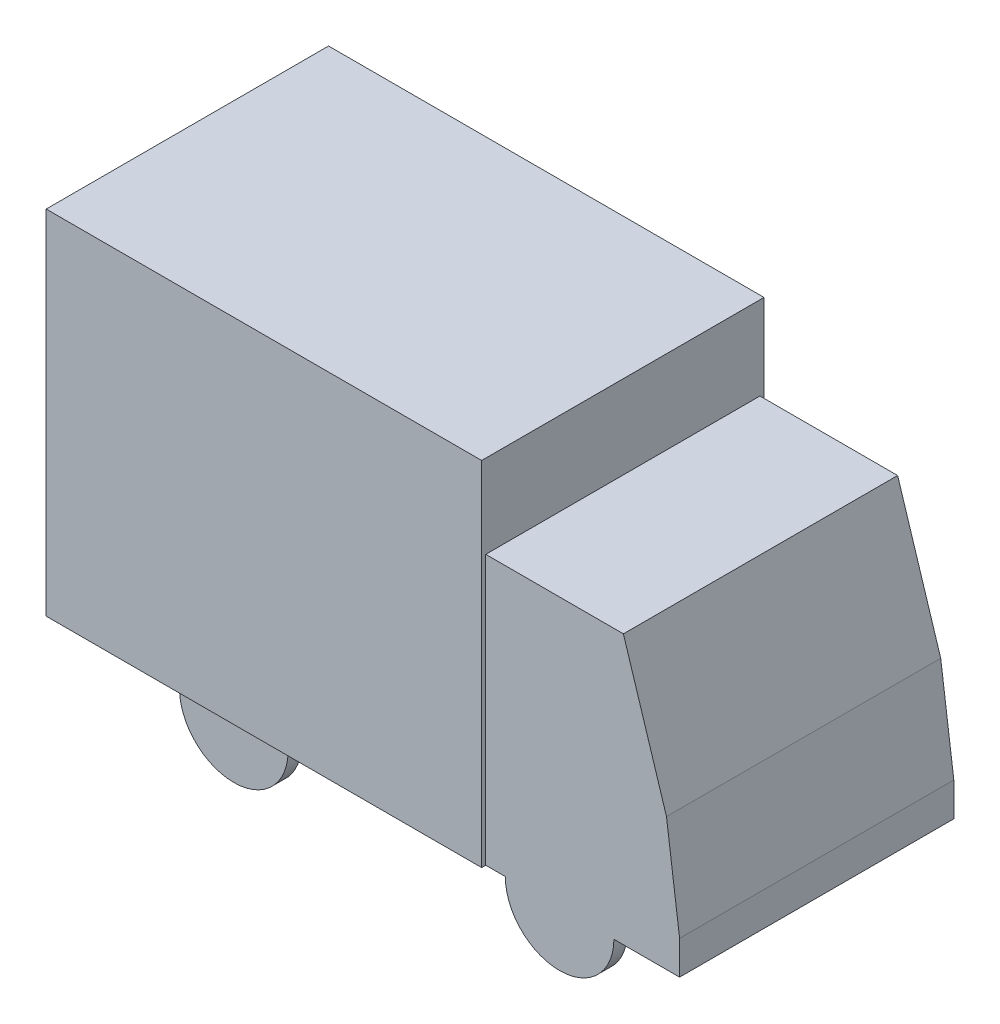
ISO-10303-21;
HEADER;
FILE_DESCRIPTION(('STEP AP214'),'2;1');
FILE_NAME('part.step','',(''),(''),'','','');
FILE_SCHEMA(('AUTOMOTIVE_DESIGN { 1 0 10303 214 1 1 1 1 }'));
ENDSEC;
DATA;
#1=APPLICATION_CONTEXT('core data for automotive mechanical design processes');
#2=APPLICATION_PROTOCOL_DEFINITION('international standard','automotive_design',2000,#1);
#3=PRODUCT_CONTEXT('',#1,'mechanical');
#4=PRODUCT('Part','Part','',(#3));
#5=PRODUCT_RELATED_PRODUCT_CATEGORY('part','',(#4));
#6=PRODUCT_DEFINITION_FORMATION('','',#4);
#7=PRODUCT_DEFINITION_CONTEXT('part definition',#1,'design');
#8=PRODUCT_DEFINITION('design','',#6,#7);
#9=PRODUCT_DEFINITION_SHAPE('','',#8);
#10=(LENGTH_UNIT() NAMED_UNIT(*) SI_UNIT(.MILLI.,.METRE.));
#11=(NAMED_UNIT(*) PLANE_ANGLE_UNIT() SI_UNIT($,.RADIAN.));
#12=(NAMED_UNIT(*) SI_UNIT($,.STERADIAN.) SOLID_ANGLE_UNIT());
#13=UNCERTAINTY_MEASURE_WITH_UNIT(LENGTH_MEASURE(1.E-05),#10,'distance_accuracy_value','');
#14=(GEOMETRIC_REPRESENTATION_CONTEXT(3) GLOBAL_UNCERTAINTY_ASSIGNED_CONTEXT((#13)) GLOBAL_UNIT_ASSIGNED_CONTEXT((#10,
#11,#12)) REPRESENTATION_CONTEXT('',''));
#15=CARTESIAN_POINT('',(0.,0.,0.));
#16=DIRECTION('',(0.,0.,1.));
#17=DIRECTION('',(1.,0.,0.));
#18=AXIS2_PLACEMENT_3D('',#15,#16,#17);
#19=CARTESIAN_POINT('',(-4689.83155744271,3246.60287543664,-1300.));
#20=DIRECTION('',(-1.,0.,0.));
#21=DIRECTION('',(0.,0.,1.));
#22=AXIS2_PLACEMENT_3D('',#19,#20,#21);
#23=PLANE('',#22);
#24=DIRECTION('',(0.,0.,1.));
#25=VECTOR('',#24,1.);
#26=CARTESIAN_POINT('',(-4689.83155744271,0.,-1300.));
#27=LINE('',#26,#25);
#28=CARTESIAN_POINT('',(-4689.83155744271,0.,-1300.));
#29=VERTEX_POINT('',#28);
#30=CARTESIAN_POINT('',(-4689.83155744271,0.,1300.));
#31=VERTEX_POINT('',#30);
#32=EDGE_CURVE('E294',#29,#31,#27,.T.);
#33=ORIENTED_EDGE('',*,*,#32,.T.);
#34=DIRECTION('',(0.,-1.,0.));
#35=VECTOR('',#34,1.);
#36=CARTESIAN_POINT('',(-4689.83155744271,3246.60287543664,1300.));
#37=LINE('',#36,#35);
#38=CARTESIAN_POINT('',(-4689.83155744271,3246.60287543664,1300.));
#39=VERTEX_POINT('',#38);
#40=EDGE_CURVE('E217',#39,#31,#37,.T.);
#41=ORIENTED_EDGE('',*,*,#40,.F.);
#42=DIRECTION('',(0.,0.,1.));
#43=VECTOR('',#42,1.);
#44=CARTESIAN_POINT('',(-4689.83155744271,3246.60287543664,-1300.));
#45=LINE('',#44,#43);
#46=CARTESIAN_POINT('',(-4689.83155744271,3246.60287543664,-1300.));
#47=VERTEX_POINT('',#46);
#48=EDGE_CURVE('E295',#47,#39,#45,.T.);
#49=ORIENTED_EDGE('',*,*,#48,.F.);
#50=DIRECTION('',(0.,-1.,0.));
#51=VECTOR('',#50,1.);
#52=CARTESIAN_POINT('',(-4689.83155744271,3246.60287543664,-1300.));
#53=LINE('',#52,#51);
#54=EDGE_CURVE('E278',#47,#29,#53,.T.);
#55=ORIENTED_EDGE('',*,*,#54,.T.);
#56=EDGE_LOOP('',(#33,#41,#49,#55));
#57=FACE_BOUND('',#56,.T.);
#58=ADVANCED_FACE('F45',(#57),#23,.T.);
#59=CARTESIAN_POINT('',(-4689.83155744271,3246.60287543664,-1300.));
#60=DIRECTION('',(0.,1.,0.));
#61=DIRECTION('',(0.,0.,1.));
#62=AXIS2_PLACEMENT_3D('',#59,#60,#61);
#63=PLANE('',#62);
#64=ORIENTED_EDGE('',*,*,#48,.T.);
#65=DIRECTION('',(-1.,0.,0.));
#66=VECTOR('',#65,1.);
#67=CARTESIAN_POINT('',(-4689.83155744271,3246.60287543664,1300.));
#68=LINE('',#67,#66);
#69=CARTESIAN_POINT('',(-680.168541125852,3246.60287543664,1300.));
#70=VERTEX_POINT('',#69);
#71=EDGE_CURVE('E226',#70,#39,#68,.T.);
#72=ORIENTED_EDGE('',*,*,#71,.F.);
#73=DIRECTION('',(0.,0.,1.));
#74=VECTOR('',#73,1.);
#75=CARTESIAN_POINT('',(-680.168541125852,3246.60287543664,-1300.));
#76=LINE('',#75,#74);
#77=CARTESIAN_POINT('',(-680.168541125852,3246.60287543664,-1300.));
#78=VERTEX_POINT('',#77);
#79=EDGE_CURVE('E297',#78,#70,#76,.T.);
#80=ORIENTED_EDGE('',*,*,#79,.F.);
#81=DIRECTION('',(-1.,0.,0.));
#82=VECTOR('',#81,1.);
#83=CARTESIAN_POINT('',(-4689.83155744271,3246.60287543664,-1300.));
#84=LINE('',#83,#82);
#85=EDGE_CURVE('E291',#78,#47,#84,.T.);
#86=ORIENTED_EDGE('',*,*,#85,.T.);
#87=EDGE_LOOP('',(#64,#72,#80,#86));
#88=FACE_BOUND('',#87,.T.);
#89=ADVANCED_FACE('F332',(#88),#63,.T.);
#90=CARTESIAN_POINT('',(-680.168541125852,3246.60287543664,-1300.));
#91=DIRECTION('',(1.,0.,0.));
#92=DIRECTION('',(0.,1.,0.));
#93=AXIS2_PLACEMENT_3D('',#90,#91,#92);
#94=PLANE('',#93);
#95=DIRECTION('',(0.,0.,1.));
#96=VECTOR('',#95,1.);
#97=CARTESIAN_POINT('',(-680.168541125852,2479.16199704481,-4317.37792736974));
#98=LINE('',#97,#96);
#99=CARTESIAN_POINT('',(-680.168541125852,2479.16199704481,-1262.5));
#100=VERTEX_POINT('',#99);
#101=CARTESIAN_POINT('',(-680.168541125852,2479.16199704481,1262.5));
#102=VERTEX_POINT('',#101);
#103=EDGE_CURVE('E188',#100,#102,#98,.T.);
#104=ORIENTED_EDGE('',*,*,#103,.F.);
#105=DIRECTION('',(0.,-1.,0.));
#106=VECTOR('',#105,1.);
#107=CARTESIAN_POINT('',(-680.168541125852,0.,-1262.5));
#108=LINE('',#107,#106);
#109=CARTESIAN_POINT('',(-680.168541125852,0.,-1262.5));
#110=VERTEX_POINT('',#109);
#111=EDGE_CURVE('E181',#100,#110,#108,.T.);
#112=ORIENTED_EDGE('',*,*,#111,.T.);
#113=DIRECTION('',(0.,0.,1.));
#114=VECTOR('',#113,1.);
#115=CARTESIAN_POINT('',(-680.168541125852,0.,-1300.));
#116=LINE('',#115,#114);
#117=CARTESIAN_POINT('',(-680.168541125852,0.,-1300.));
#118=VERTEX_POINT('',#117);
#119=EDGE_CURVE('E299',#118,#110,#116,.T.);
#120=ORIENTED_EDGE('',*,*,#119,.F.);
#121=DIRECTION('',(0.,1.,0.));
#122=VECTOR('',#121,1.);
#123=CARTESIAN_POINT('',(-680.168541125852,3246.60287543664,-1300.));
#124=LINE('',#123,#122);
#125=EDGE_CURVE('E287',#118,#78,#124,.T.);
#126=ORIENTED_EDGE('',*,*,#125,.T.);
#127=ORIENTED_EDGE('',*,*,#79,.T.);
#128=DIRECTION('',(0.,1.,0.));
#129=VECTOR('',#128,1.);
#130=CARTESIAN_POINT('',(-680.168541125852,3246.60287543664,1300.));
#131=LINE('',#130,#129);
#132=CARTESIAN_POINT('',(-680.168541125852,0.,1300.));
#133=VERTEX_POINT('',#132);
#134=EDGE_CURVE('E223',#133,#70,#131,.T.);
#135=ORIENTED_EDGE('',*,*,#134,.F.);
#136=DIRECTION('',(0.,0.,-1.));
#137=VECTOR('',#136,1.);
#138=CARTESIAN_POINT('',(-680.168541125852,0.,1300.));
#139=LINE('',#138,#137);
#140=CARTESIAN_POINT('',(-680.168541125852,0.,1262.5));
#141=VERTEX_POINT('',#140);
#142=EDGE_CURVE('E229',#133,#141,#139,.T.);
#143=ORIENTED_EDGE('',*,*,#142,.T.);
#144=DIRECTION('',(0.,-1.,0.));
#145=VECTOR('',#144,1.);
#146=CARTESIAN_POINT('',(-680.168541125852,0.,1262.5));
#147=LINE('',#146,#145);
#148=EDGE_CURVE('E203',#102,#141,#147,.T.);
#149=ORIENTED_EDGE('',*,*,#148,.F.);
#150=EDGE_LOOP('',(#104,#112,#120,#126,#127,#135,#143,#149));
#151=FACE_BOUND('',#150,.T.);
#152=ADVANCED_FACE('F337',(#151),#94,.T.);
#153=CARTESIAN_POINT('',(-4689.83155744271,0.,-1300.));
#154=DIRECTION('',(0.,-1.,0.));
#155=DIRECTION('',(0.,0.,-1.));
#156=AXIS2_PLACEMENT_3D('',#153,#154,#155);
#157=PLANE('',#156);
#158=DIRECTION('',(0.,0.,-1.));
#159=VECTOR('',#158,1.);
#160=CARTESIAN_POINT('',(-3500.,0.,-1137.5));
#161=LINE('',#160,#159);
#162=CARTESIAN_POINT('',(-3500.,0.,-1137.5));
#163=VERTEX_POINT('',#162);
#164=CARTESIAN_POINT('',(-3500.,0.,-1262.5));
#165=VERTEX_POINT('',#164);
#166=EDGE_CURVE('E304',#163,#165,#161,.T.);
#167=ORIENTED_EDGE('',*,*,#166,.F.);
#168=DIRECTION('',(1.,0.,0.));
#169=VECTOR('',#168,1.);
#170=CARTESIAN_POINT('',(-3000.,0.,-1137.5));
#171=LINE('',#170,#169);
#172=CARTESIAN_POINT('',(-2500.,0.,-1137.5));
#173=VERTEX_POINT('',#172);
#174=EDGE_CURVE('E307',#163,#173,#171,.T.);
#175=ORIENTED_EDGE('',*,*,#174,.T.);
#176=DIRECTION('',(0.,0.,-1.));
#177=VECTOR('',#176,1.);
#178=CARTESIAN_POINT('',(-2500.,0.,-1137.5));
#179=LINE('',#178,#177);
#180=CARTESIAN_POINT('',(-2500.,0.,-1262.5));
#181=VERTEX_POINT('',#180);
#182=EDGE_CURVE('E68',#181,#173,#179,.F.);
#183=ORIENTED_EDGE('',*,*,#182,.F.);
#184=DIRECTION('',(1.,0.,0.));
#185=VECTOR('',#184,1.);
#186=CARTESIAN_POINT('',(-3000.,0.,-1262.5));
#187=LINE('',#186,#185);
#188=EDGE_CURVE('E11',#165,#181,#187,.T.);
#189=ORIENTED_EDGE('',*,*,#188,.F.);
#190=EDGE_LOOP('',(#167,#175,#183,#189));
#191=FACE_BOUND('',#190,.T.);
#192=DIRECTION('',(0.,0.,1.));
#193=VECTOR('',#192,1.);
#194=CARTESIAN_POINT('',(1104.77822097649,0.,-4317.37792736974));
#195=LINE('',#194,#193);
#196=CARTESIAN_POINT('',(1104.77822097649,0.,-1262.5));
#197=VERTEX_POINT('',#196);
#198=CARTESIAN_POINT('',(1104.77822097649,0.,1262.5));
#199=VERTEX_POINT('',#198);
#200=EDGE_CURVE('E262',#197,#199,#195,.T.);
#201=ORIENTED_EDGE('',*,*,#200,.T.);
#202=DIRECTION('',(1.,0.,0.));
#203=VECTOR('',#202,1.);
#204=CARTESIAN_POINT('',(1104.77822097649,0.,1262.5));
#205=LINE('',#204,#203);
#206=CARTESIAN_POINT('',(500.,0.,1262.5));
#207=VERTEX_POINT('',#206);
#208=EDGE_CURVE('E205',#207,#199,#205,.T.);
#209=ORIENTED_EDGE('',*,*,#208,.F.);
#210=DIRECTION('',(0.,0.,1.));
#211=VECTOR('',#210,1.);
#212=CARTESIAN_POINT('',(500.,0.,1137.5));
#213=LINE('',#212,#211);
#214=CARTESIAN_POINT('',(500.,0.,1137.5));
#215=VERTEX_POINT('',#214);
#216=EDGE_CURVE('E211',#215,#207,#213,.T.);
#217=ORIENTED_EDGE('',*,*,#216,.F.);
#218=DIRECTION('',(-1.,0.,0.));
#219=VECTOR('',#218,1.);
#220=CARTESIAN_POINT('',(0.,0.,1137.5));
#221=LINE('',#220,#219);
#222=CARTESIAN_POINT('',(-500.,0.,1137.5));
#223=VERTEX_POINT('',#222);
#224=EDGE_CURVE('E192',#215,#223,#221,.T.);
#225=ORIENTED_EDGE('',*,*,#224,.T.);
#226=DIRECTION('',(0.,0.,1.));
#227=VECTOR('',#226,1.);
#228=CARTESIAN_POINT('',(-500.,0.,1137.5));
#229=LINE('',#228,#227);
#230=CARTESIAN_POINT('',(-500.,0.,1262.5));
#231=VERTEX_POINT('',#230);
#232=EDGE_CURVE('E208',#231,#223,#229,.F.);
#233=ORIENTED_EDGE('',*,*,#232,.F.);
#234=EDGE_CURVE('E406',#141,#231,#205,.T.);
#235=ORIENTED_EDGE('',*,*,#234,.F.);
#236=ORIENTED_EDGE('',*,*,#142,.F.);
#237=DIRECTION('',(1.,0.,0.));
#238=VECTOR('',#237,1.);
#239=CARTESIAN_POINT('',(-4689.83155744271,0.,1300.));
#240=LINE('',#239,#238);
#241=EDGE_CURVE('E221',#31,#133,#240,.T.);
#242=ORIENTED_EDGE('',*,*,#241,.F.);
#243=ORIENTED_EDGE('',*,*,#32,.F.);
#244=DIRECTION('',(1.,0.,0.));
#245=VECTOR('',#244,1.);
#246=CARTESIAN_POINT('',(-4689.83155744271,0.,-1300.));
#247=LINE('',#246,#245);
#248=EDGE_CURVE('E283',#29,#118,#247,.T.);
#249=ORIENTED_EDGE('',*,*,#248,.T.);
#250=ORIENTED_EDGE('',*,*,#119,.T.);
#251=DIRECTION('',(1.,0.,0.));
#252=VECTOR('',#251,1.);
#253=CARTESIAN_POINT('',(1104.77822097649,0.,-1262.5));
#254=LINE('',#253,#252);
#255=CARTESIAN_POINT('',(-500.,0.,-1262.5));
#256=VERTEX_POINT('',#255);
#257=EDGE_CURVE('E60',#110,#256,#254,.T.);
#258=ORIENTED_EDGE('',*,*,#257,.T.);
#259=DIRECTION('',(0.,0.,-1.));
#260=VECTOR('',#259,1.);
#261=CARTESIAN_POINT('',(-500.,0.,-1137.5));
#262=LINE('',#261,#260);
#263=CARTESIAN_POINT('',(-500.,0.,-1137.5));
#264=VERTEX_POINT('',#263);
#265=EDGE_CURVE('E270',#256,#264,#262,.F.);
#266=ORIENTED_EDGE('',*,*,#265,.T.);
#267=DIRECTION('',(-1.,0.,0.));
#268=VECTOR('',#267,1.);
#269=CARTESIAN_POINT('',(0.,0.,-1137.5));
#270=LINE('',#269,#268);
#271=CARTESIAN_POINT('',(500.,0.,-1137.5));
#272=VERTEX_POINT('',#271);
#273=EDGE_CURVE('E260',#272,#264,#270,.T.);
#274=ORIENTED_EDGE('',*,*,#273,.F.);
#275=DIRECTION('',(0.,0.,-1.));
#276=VECTOR('',#275,1.);
#277=CARTESIAN_POINT('',(500.,0.,-1137.5));
#278=LINE('',#277,#276);
#279=CARTESIAN_POINT('',(500.,0.,-1262.5));
#280=VERTEX_POINT('',#279);
#281=EDGE_CURVE('E272',#272,#280,#278,.T.);
#282=ORIENTED_EDGE('',*,*,#281,.T.);
#283=EDGE_CURVE('E250',#280,#197,#254,.T.);
#284=ORIENTED_EDGE('',*,*,#283,.T.);
#285=EDGE_LOOP('',(#201,#209,#217,#225,#233,#235,#236,#242,#243,#249,#250,#258,#266,#274,#282,#284));
#286=FACE_BOUND('',#285,.T.);
#287=DIRECTION('',(0.,0.,1.));
#288=VECTOR('',#287,1.);
#289=CARTESIAN_POINT('',(-3500.,0.,1137.5));
#290=LINE('',#289,#288);
#291=CARTESIAN_POINT('',(-3500.,0.,1137.5));
#292=VERTEX_POINT('',#291);
#293=CARTESIAN_POINT('',(-3500.,0.,1262.5));
#294=VERTEX_POINT('',#293);
#295=EDGE_CURVE('E235',#292,#294,#290,.T.);
#296=ORIENTED_EDGE('',*,*,#295,.T.);
#297=DIRECTION('',(1.,0.,0.));
#298=VECTOR('',#297,1.);
#299=CARTESIAN_POINT('',(-3000.,0.,1262.5));
#300=LINE('',#299,#298);
#301=CARTESIAN_POINT('',(-2500.,0.,1262.5));
#302=VERTEX_POINT('',#301);
#303=EDGE_CURVE('E244',#294,#302,#300,.T.);
#304=ORIENTED_EDGE('',*,*,#303,.T.);
#305=DIRECTION('',(0.,0.,1.));
#306=VECTOR('',#305,1.);
#307=CARTESIAN_POINT('',(-2500.,0.,1137.5));
#308=LINE('',#307,#306);
#309=CARTESIAN_POINT('',(-2500.,0.,1137.5));
#310=VERTEX_POINT('',#309);
#311=EDGE_CURVE('E232',#302,#310,#308,.F.);
#312=ORIENTED_EDGE('',*,*,#311,.T.);
#313=DIRECTION('',(1.,0.,0.));
#314=VECTOR('',#313,1.);
#315=CARTESIAN_POINT('',(-3000.,0.,1137.5));
#316=LINE('',#315,#314);
#317=EDGE_CURVE('E238',#292,#310,#316,.T.);
#318=ORIENTED_EDGE('',*,*,#317,.F.);
#319=EDGE_LOOP('',(#296,#304,#312,#318));
#320=FACE_BOUND('',#319,.T.);
#321=ADVANCED_FACE('F317',(#191,#286,#320),#157,.T.);
#322=CARTESIAN_POINT('',(0.,0.,-1300.));
#323=DIRECTION('',(0.,0.,1.));
#324=DIRECTION('',(1.,0.,0.));
#325=AXIS2_PLACEMENT_3D('',#322,#323,#324);
#326=PLANE('',#325);
#327=ORIENTED_EDGE('',*,*,#54,.F.);
#328=ORIENTED_EDGE('',*,*,#85,.F.);
#329=ORIENTED_EDGE('',*,*,#125,.F.);
#330=ORIENTED_EDGE('',*,*,#248,.F.);
#331=EDGE_LOOP('',(#327,#328,#329,#330));
#332=FACE_BOUND('',#331,.T.);
#333=ADVANCED_FACE('F329',(#332),#326,.F.);
#334=CARTESIAN_POINT('',(-3000.,-2.09488880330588E-11,-1137.5));
#335=DIRECTION('',(0.,0.,-1.));
#336=DIRECTION('',(-1.,0.,0.));
#337=AXIS2_PLACEMENT_3D('',#334,#335,#336);
#338=CYLINDRICAL_SURFACE('',#337,500.);
#339=CARTESIAN_POINT('',(-3000.,-2.09488880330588E-11,-1137.5));
#340=DIRECTION('',(0.,0.,1.));
#341=DIRECTION('',(1.,0.,0.));
#342=AXIS2_PLACEMENT_3D('',#339,#340,#341);
#343=CIRCLE('',#342,500.);
#344=EDGE_CURVE('E53',#163,#173,#343,.T.);
#345=ORIENTED_EDGE('',*,*,#344,.F.);
#346=ORIENTED_EDGE('',*,*,#166,.T.);
#347=CARTESIAN_POINT('',(-3000.,-2.09488880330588E-11,-1262.5));
#348=DIRECTION('',(0.,0.,1.));
#349=DIRECTION('',(1.,0.,0.));
#350=AXIS2_PLACEMENT_3D('',#347,#348,#349);
#351=CIRCLE('',#350,500.);
#352=EDGE_CURVE('E309',#165,#181,#351,.T.);
#353=ORIENTED_EDGE('',*,*,#352,.T.);
#354=ORIENTED_EDGE('',*,*,#182,.T.);
#355=EDGE_LOOP('',(#345,#346,#353,#354));
#356=FACE_BOUND('',#355,.T.);
#357=ADVANCED_FACE('F47',(#356),#338,.T.);
#358=CARTESIAN_POINT('',(-3000.,-2.09488880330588E-11,-1137.5));
#359=DIRECTION('',(0.,0.,1.));
#360=DIRECTION('',(1.,0.,0.));
#361=AXIS2_PLACEMENT_3D('',#358,#359,#360);
#362=PLANE('',#361);
#363=ORIENTED_EDGE('',*,*,#174,.F.);
#364=ORIENTED_EDGE('',*,*,#344,.T.);
#365=EDGE_LOOP('',(#363,#364));
#366=FACE_BOUND('',#365,.T.);
#367=ADVANCED_FACE('F321',(#366),#362,.T.);
#368=CARTESIAN_POINT('',(-3000.,-2.09488880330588E-11,-1262.5));
#369=DIRECTION('',(0.,0.,1.));
#370=DIRECTION('',(1.,0.,0.));
#371=AXIS2_PLACEMENT_3D('',#368,#369,#370);
#372=PLANE('',#371);
#373=ORIENTED_EDGE('',*,*,#352,.F.);
#374=ORIENTED_EDGE('',*,*,#188,.T.);
#375=EDGE_LOOP('',(#373,#374));
#376=FACE_BOUND('',#375,.T.);
#377=ADVANCED_FACE('F316',(#376),#372,.F.);
#378=CARTESIAN_POINT('',(0.,0.,-1137.5));
#379=DIRECTION('',(0.,0.,-1.));
#380=DIRECTION('',(-1.,0.,0.));
#381=AXIS2_PLACEMENT_3D('',#378,#379,#380);
#382=CYLINDRICAL_SURFACE('',#381,500.);
#383=ORIENTED_EDGE('',*,*,#281,.F.);
#384=CARTESIAN_POINT('',(0.,0.,-1137.5));
#385=DIRECTION('',(0.,0.,1.));
#386=DIRECTION('',(1.,0.,0.));
#387=AXIS2_PLACEMENT_3D('',#384,#385,#386);
#388=CIRCLE('',#387,500.);
#389=EDGE_CURVE('E274',#264,#272,#388,.T.);
#390=ORIENTED_EDGE('',*,*,#389,.F.);
#391=ORIENTED_EDGE('',*,*,#265,.F.);
#392=CARTESIAN_POINT('',(0.,0.,-1262.5));
#393=DIRECTION('',(0.,0.,1.));
#394=DIRECTION('',(1.,0.,0.));
#395=AXIS2_PLACEMENT_3D('',#392,#393,#394);
#396=CIRCLE('',#395,500.);
#397=EDGE_CURVE('E275',#256,#280,#396,.T.);
#398=ORIENTED_EDGE('',*,*,#397,.T.);
#399=EDGE_LOOP('',(#383,#390,#391,#398));
#400=FACE_BOUND('',#399,.T.);
#401=ADVANCED_FACE('F328',(#400),#382,.T.);
#402=CARTESIAN_POINT('',(0.,0.,-1137.5));
#403=DIRECTION('',(0.,0.,1.));
#404=DIRECTION('',(1.,0.,0.));
#405=AXIS2_PLACEMENT_3D('',#402,#403,#404);
#406=PLANE('',#405);
#407=ORIENTED_EDGE('',*,*,#389,.T.);
#408=ORIENTED_EDGE('',*,*,#273,.T.);
#409=EDGE_LOOP('',(#407,#408));
#410=FACE_BOUND('',#409,.T.);
#411=ADVANCED_FACE('F349',(#410),#406,.T.);
#412=CARTESIAN_POINT('',(0.,0.,-1262.5));
#413=DIRECTION('',(0.,0.,1.));
#414=DIRECTION('',(1.,0.,0.));
#415=AXIS2_PLACEMENT_3D('',#412,#413,#414);
#416=PLANE('',#415);
#417=ORIENTED_EDGE('',*,*,#397,.F.);
#418=ORIENTED_EDGE('',*,*,#257,.F.);
#419=ORIENTED_EDGE('',*,*,#111,.F.);
#420=DIRECTION('',(-1.,0.,0.));
#421=VECTOR('',#420,1.);
#422=CARTESIAN_POINT('',(-680.168541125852,2479.16199704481,-1262.5));
#423=LINE('',#422,#421);
#424=CARTESIAN_POINT('',(587.40234790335,2479.16199704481,-1262.5));
#425=VERTEX_POINT('',#424);
#426=EDGE_CURVE('E258',#425,#100,#423,.T.);
#427=ORIENTED_EDGE('',*,*,#426,.F.);
#428=DIRECTION('',(-0.30050600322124,0.953779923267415,0.));
#429=VECTOR('',#428,1.);
#430=CARTESIAN_POINT('',(587.40234790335,2479.16199704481,-1262.5));
#431=LINE('',#430,#429);
#432=CARTESIAN_POINT('',(984.057183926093,1220.2140392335,-1262.5));
#433=VERTEX_POINT('',#432);
#434=EDGE_CURVE('E177',#433,#425,#431,.T.);
#435=ORIENTED_EDGE('',*,*,#434,.F.);
#436=DIRECTION('',(-0.131496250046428,0.991316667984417,0.));
#437=VECTOR('',#436,1.);
#438=CARTESIAN_POINT('',(984.057183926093,1220.2140392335,-1262.5));
#439=LINE('',#438,#437);
#440=CARTESIAN_POINT('',(1104.77822097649,310.12895192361,-1262.5));
#441=VERTEX_POINT('',#440);
#442=EDGE_CURVE('E253',#441,#433,#439,.T.);
#443=ORIENTED_EDGE('',*,*,#442,.F.);
#444=DIRECTION('',(0.,1.,0.));
#445=VECTOR('',#444,1.);
#446=CARTESIAN_POINT('',(1104.77822097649,310.12895192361,-1262.5));
#447=LINE('',#446,#445);
#448=EDGE_CURVE('E249',#197,#441,#447,.T.);
#449=ORIENTED_EDGE('',*,*,#448,.F.);
#450=ORIENTED_EDGE('',*,*,#283,.F.);
#451=EDGE_LOOP('',(#417,#418,#419,#427,#435,#443,#449,#450));
#452=FACE_BOUND('',#451,.T.);
#453=ADVANCED_FACE('F352',(#452),#416,.F.);
#454=CARTESIAN_POINT('',(1104.77822097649,310.12895192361,-4317.37792736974));
#455=DIRECTION('',(-1.,0.,0.));
#456=DIRECTION('',(0.,0.,1.));
#457=AXIS2_PLACEMENT_3D('',#454,#455,#456);
#458=PLANE('',#457);
#459=ORIENTED_EDGE('',*,*,#200,.F.);
#460=ORIENTED_EDGE('',*,*,#448,.T.);
#461=DIRECTION('',(0.,0.,1.));
#462=VECTOR('',#461,1.);
#463=CARTESIAN_POINT('',(1104.77822097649,310.12895192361,-4317.37792736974));
#464=LINE('',#463,#462);
#465=CARTESIAN_POINT('',(1104.77822097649,310.12895192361,1262.5));
#466=VERTEX_POINT('',#465);
#467=EDGE_CURVE('E264',#441,#466,#464,.T.);
#468=ORIENTED_EDGE('',*,*,#467,.T.);
#469=DIRECTION('',(0.,1.,0.));
#470=VECTOR('',#469,1.);
#471=CARTESIAN_POINT('',(1104.77822097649,310.12895192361,1262.5));
#472=LINE('',#471,#470);
#473=EDGE_CURVE('E199',#199,#466,#472,.T.);
#474=ORIENTED_EDGE('',*,*,#473,.F.);
#475=EDGE_LOOP('',(#459,#460,#468,#474));
#476=FACE_BOUND('',#475,.T.);
#477=ADVANCED_FACE('F356',(#476),#458,.F.);
#478=CARTESIAN_POINT('',(984.057183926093,1220.2140392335,-4317.37792736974));
#479=DIRECTION('',(-0.991316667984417,-0.131496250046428,0.));
#480=DIRECTION('',(0.131496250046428,-0.991316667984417,0.));
#481=AXIS2_PLACEMENT_3D('',#478,#479,#480);
#482=PLANE('',#481);
#483=ORIENTED_EDGE('',*,*,#467,.F.);
#484=ORIENTED_EDGE('',*,*,#442,.T.);
#485=DIRECTION('',(0.,0.,1.));
#486=VECTOR('',#485,1.);
#487=CARTESIAN_POINT('',(984.057183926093,1220.2140392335,-4317.37792736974));
#488=LINE('',#487,#486);
#489=CARTESIAN_POINT('',(984.057183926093,1220.2140392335,1262.5));
#490=VERTEX_POINT('',#489);
#491=EDGE_CURVE('E182',#433,#490,#488,.T.);
#492=ORIENTED_EDGE('',*,*,#491,.T.);
#493=DIRECTION('',(-0.131496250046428,0.991316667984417,0.));
#494=VECTOR('',#493,1.);
#495=CARTESIAN_POINT('',(984.057183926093,1220.2140392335,1262.5));
#496=LINE('',#495,#494);
#497=EDGE_CURVE('E197',#466,#490,#496,.T.);
#498=ORIENTED_EDGE('',*,*,#497,.F.);
#499=EDGE_LOOP('',(#483,#484,#492,#498));
#500=FACE_BOUND('',#499,.T.);
#501=ADVANCED_FACE('F365',(#500),#482,.F.);
#502=CARTESIAN_POINT('',(587.40234790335,2479.16199704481,-4317.37792736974));
#503=DIRECTION('',(-0.953779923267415,-0.30050600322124,0.));
#504=DIRECTION('',(0.30050600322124,-0.953779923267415,0.));
#505=AXIS2_PLACEMENT_3D('',#502,#503,#504);
#506=PLANE('',#505);
#507=ORIENTED_EDGE('',*,*,#491,.F.);
#508=ORIENTED_EDGE('',*,*,#434,.T.);
#509=DIRECTION('',(0.,0.,1.));
#510=VECTOR('',#509,1.);
#511=CARTESIAN_POINT('',(587.40234790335,2479.16199704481,-4317.37792736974));
#512=LINE('',#511,#510);
#513=CARTESIAN_POINT('',(587.40234790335,2479.16199704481,1262.5));
#514=VERTEX_POINT('',#513);
#515=EDGE_CURVE('E170',#425,#514,#512,.T.);
#516=ORIENTED_EDGE('',*,*,#515,.T.);
#517=DIRECTION('',(-0.30050600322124,0.953779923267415,0.));
#518=VECTOR('',#517,1.);
#519=CARTESIAN_POINT('',(587.40234790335,2479.16199704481,1262.5));
#520=LINE('',#519,#518);
#521=EDGE_CURVE('E175',#490,#514,#520,.T.);
#522=ORIENTED_EDGE('',*,*,#521,.F.);
#523=EDGE_LOOP('',(#507,#508,#516,#522));
#524=FACE_BOUND('',#523,.T.);
#525=ADVANCED_FACE('F173',(#524),#506,.F.);
#526=CARTESIAN_POINT('',(-680.168541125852,2479.16199704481,-4317.37792736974));
#527=DIRECTION('',(0.,-1.,0.));
#528=DIRECTION('',(0.,0.,-1.));
#529=AXIS2_PLACEMENT_3D('',#526,#527,#528);
#530=PLANE('',#529);
#531=ORIENTED_EDGE('',*,*,#515,.F.);
#532=ORIENTED_EDGE('',*,*,#426,.T.);
#533=ORIENTED_EDGE('',*,*,#103,.T.);
#534=DIRECTION('',(-1.,0.,0.));
#535=VECTOR('',#534,1.);
#536=CARTESIAN_POINT('',(-680.168541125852,2479.16199704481,1262.5));
#537=LINE('',#536,#535);
#538=EDGE_CURVE('E185',#514,#102,#537,.T.);
#539=ORIENTED_EDGE('',*,*,#538,.F.);
#540=EDGE_LOOP('',(#531,#532,#533,#539));
#541=FACE_BOUND('',#540,.T.);
#542=ADVANCED_FACE('F186',(#541),#530,.F.);
#543=CARTESIAN_POINT('',(0.,0.,1300.));
#544=DIRECTION('',(0.,0.,-1.));
#545=DIRECTION('',(1.,0.,0.));
#546=AXIS2_PLACEMENT_3D('',#543,#544,#545);
#547=PLANE('',#546);
#548=ORIENTED_EDGE('',*,*,#40,.T.);
#549=ORIENTED_EDGE('',*,*,#241,.T.);
#550=ORIENTED_EDGE('',*,*,#134,.T.);
#551=ORIENTED_EDGE('',*,*,#71,.T.);
#552=EDGE_LOOP('',(#548,#549,#550,#551));
#553=FACE_BOUND('',#552,.T.);
#554=ADVANCED_FACE('F362',(#553),#547,.F.);
#555=CARTESIAN_POINT('',(-3000.,-2.09488880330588E-11,1137.5));
#556=DIRECTION('',(0.,0.,1.));
#557=DIRECTION('',(-1.,0.,0.));
#558=AXIS2_PLACEMENT_3D('',#555,#556,#557);
#559=CYLINDRICAL_SURFACE('',#558,500.);
#560=CARTESIAN_POINT('',(-3000.,-2.09488880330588E-11,1137.5));
#561=DIRECTION('',(0.,0.,1.));
#562=DIRECTION('',(1.,0.,0.));
#563=AXIS2_PLACEMENT_3D('',#560,#561,#562);
#564=CIRCLE('',#563,500.);
#565=EDGE_CURVE('E242',#292,#310,#564,.T.);
#566=ORIENTED_EDGE('',*,*,#565,.T.);
#567=ORIENTED_EDGE('',*,*,#311,.F.);
#568=CARTESIAN_POINT('',(-3000.,-2.09488880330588E-11,1262.5));
#569=DIRECTION('',(0.,0.,1.));
#570=DIRECTION('',(1.,0.,0.));
#571=AXIS2_PLACEMENT_3D('',#568,#569,#570);
#572=CIRCLE('',#571,500.);
#573=EDGE_CURVE('E241',#294,#302,#572,.T.);
#574=ORIENTED_EDGE('',*,*,#573,.F.);
#575=ORIENTED_EDGE('',*,*,#295,.F.);
#576=EDGE_LOOP('',(#566,#567,#574,#575));
#577=FACE_BOUND('',#576,.T.);
#578=ADVANCED_FACE('F372',(#577),#559,.T.);
#579=CARTESIAN_POINT('',(-3000.,-2.09488880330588E-11,1137.5));
#580=DIRECTION('',(0.,0.,-1.));
#581=DIRECTION('',(1.,0.,0.));
#582=AXIS2_PLACEMENT_3D('',#579,#580,#581);
#583=PLANE('',#582);
#584=ORIENTED_EDGE('',*,*,#317,.T.);
#585=ORIENTED_EDGE('',*,*,#565,.F.);
#586=EDGE_LOOP('',(#584,#585));
#587=FACE_BOUND('',#586,.T.);
#588=ADVANCED_FACE('F375',(#587),#583,.T.);
#589=CARTESIAN_POINT('',(-3000.,-2.09488880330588E-11,1262.5));
#590=DIRECTION('',(0.,0.,-1.));
#591=DIRECTION('',(1.,0.,0.));
#592=AXIS2_PLACEMENT_3D('',#589,#590,#591);
#593=PLANE('',#592);
#594=ORIENTED_EDGE('',*,*,#573,.T.);
#595=ORIENTED_EDGE('',*,*,#303,.F.);
#596=EDGE_LOOP('',(#594,#595));
#597=FACE_BOUND('',#596,.T.);
#598=ADVANCED_FACE('F377',(#597),#593,.F.);
#599=CARTESIAN_POINT('',(0.,0.,1137.5));
#600=DIRECTION('',(0.,0.,1.));
#601=DIRECTION('',(-1.,0.,0.));
#602=AXIS2_PLACEMENT_3D('',#599,#600,#601);
#603=CYLINDRICAL_SURFACE('',#602,500.);
#604=ORIENTED_EDGE('',*,*,#216,.T.);
#605=CARTESIAN_POINT('',(0.,0.,1262.5));
#606=DIRECTION('',(0.,0.,1.));
#607=DIRECTION('',(1.,0.,0.));
#608=AXIS2_PLACEMENT_3D('',#605,#606,#607);
#609=CIRCLE('',#608,500.);
#610=EDGE_CURVE('E215',#231,#207,#609,.T.);
#611=ORIENTED_EDGE('',*,*,#610,.F.);
#612=ORIENTED_EDGE('',*,*,#232,.T.);
#613=CARTESIAN_POINT('',(0.,0.,1137.5));
#614=DIRECTION('',(0.,0.,1.));
#615=DIRECTION('',(1.,0.,0.));
#616=AXIS2_PLACEMENT_3D('',#613,#614,#615);
#617=CIRCLE('',#616,500.);
#618=EDGE_CURVE('E214',#223,#215,#617,.T.);
#619=ORIENTED_EDGE('',*,*,#618,.T.);
#620=EDGE_LOOP('',(#604,#611,#612,#619));
#621=FACE_BOUND('',#620,.T.);
#622=ADVANCED_FACE('F380',(#621),#603,.T.);
#623=CARTESIAN_POINT('',(0.,0.,1137.5));
#624=DIRECTION('',(0.,0.,-1.));
#625=DIRECTION('',(1.,0.,0.));
#626=AXIS2_PLACEMENT_3D('',#623,#624,#625);
#627=PLANE('',#626);
#628=ORIENTED_EDGE('',*,*,#618,.F.);
#629=ORIENTED_EDGE('',*,*,#224,.F.);
#630=EDGE_LOOP('',(#628,#629));
#631=FACE_BOUND('',#630,.T.);
#632=ADVANCED_FACE('F388',(#631),#627,.T.);
#633=CARTESIAN_POINT('',(0.,0.,1262.5));
#634=DIRECTION('',(0.,0.,-1.));
#635=DIRECTION('',(1.,0.,0.));
#636=AXIS2_PLACEMENT_3D('',#633,#634,#635);
#637=PLANE('',#636);
#638=ORIENTED_EDGE('',*,*,#610,.T.);
#639=ORIENTED_EDGE('',*,*,#208,.T.);
#640=ORIENTED_EDGE('',*,*,#473,.T.);
#641=ORIENTED_EDGE('',*,*,#497,.T.);
#642=ORIENTED_EDGE('',*,*,#521,.T.);
#643=ORIENTED_EDGE('',*,*,#538,.T.);
#644=ORIENTED_EDGE('',*,*,#148,.T.);
#645=ORIENTED_EDGE('',*,*,#234,.T.);
#646=EDGE_LOOP('',(#638,#639,#640,#641,#642,#643,#644,#645));
#647=FACE_BOUND('',#646,.T.);
#648=ADVANCED_FACE('F194',(#647),#637,.F.);
#649=CLOSED_SHELL('',(#58,#89,#152,#321,#333,#357,#367,#377,#401,#411,#453,#477,#501,#525,#542,
#554,#578,#588,#598,#622,#632,#648));
#650=MANIFOLD_SOLID_BREP('B2',#649);
#651=ADVANCED_BREP_SHAPE_REPRESENTATION('',(#18,#650),#14);
#652=SHAPE_DEFINITION_REPRESENTATION(#9,#651);
ENDSEC;
END-ISO-10303-21;
